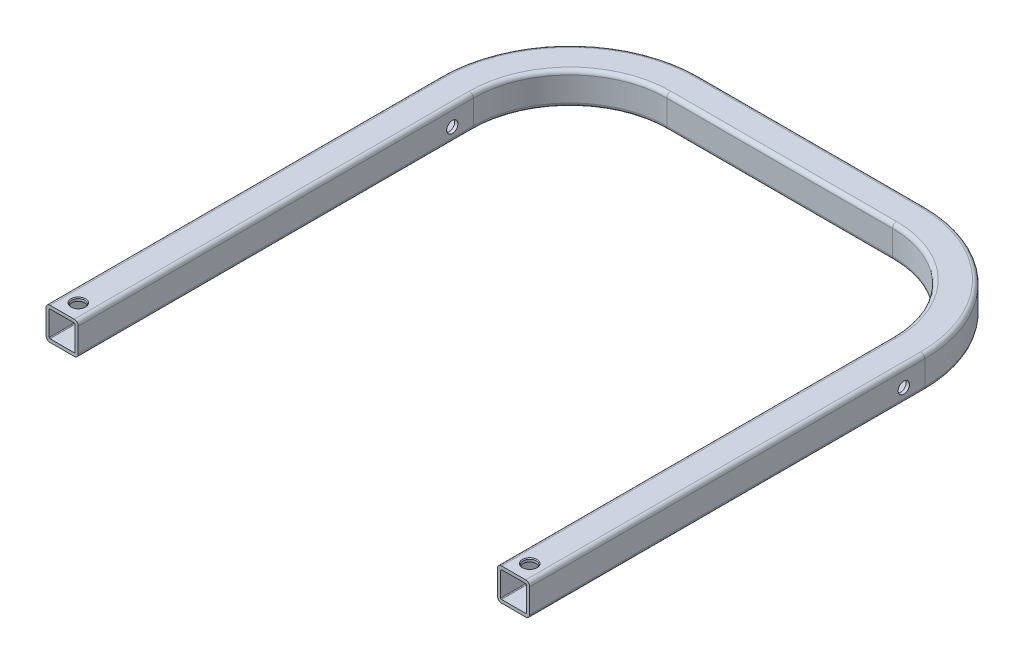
from build123d import *

# Parameters (mm, degrees)
ENL_V_MAT_EXTRU_1_REACH = 360.504
ESQUISSE3_R             = 4
CHANFREIN1_SIZE         = 0.5
ESQUISSE4_R             = 3.5
ENL_V_MAT_EXTRU_2_DEPTH = 443.747106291


with BuildPart() as part:
    # Balayage1: sweep along a path in Esquisse1
    with BuildLine(Plane(origin=(0, 0, 0), x_dir=(1, 0, 0), z_dir=(0, 1, 0))) as balayage1_path:
        Line((-150, 0), (-150, 245))
        ThreePointArc((-150, 245), (-126.568542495, 301.568542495), (-70, 325))
        Line((-70, 325), (70, 325))
        ThreePointArc((70, 325), (126.568542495, 301.568542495), (150, 245))
        Line((150, 245), (150, 0))
    # Esquisse2 → Balayage1 (sweep)
    with BuildSketch(Plane.XY):
        with BuildLine():
            Line((-147.5, 0), (-132.5, 0))
            ThreePointArc((-132.5, 0), (-130.732233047, -0.732233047), (-130, -2.5))
            Line((-130, -2.5), (-130, -17.5))
            ThreePointArc((-130, -17.5), (-130.732233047, -19.267766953), (-132.5, -20))
            Line((-132.5, -20), (-147.5, -20))
            ThreePointArc((-147.5, -20), (-149.267766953, -19.267766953), (-150, -17.5))
            Line((-150, -17.5), (-150, -2.5))
            ThreePointArc((-150, -2.5), (-149.267766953, -0.732233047), (-147.5, 0))
        make_face()
        with BuildLine():
            Line((-147.5, -2), (-132.5, -2))
            ThreePointArc((-132.5, -2), (-132.146446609, -2.146446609), (-132, -2.5))
            Line((-132, -2.5), (-132, -17.5))
            ThreePointArc((-132, -17.5), (-132.146446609, -17.853553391), (-132.5, -18))
            Line((-132.5, -18), (-147.5, -18))
            ThreePointArc((-147.5, -18), (-147.853553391, -17.853553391), (-148, -17.5))
            Line((-148, -17.5), (-148, -2.5))
            ThreePointArc((-148, -2.5), (-147.853553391, -2.146446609), (-147.5, -2))
        make_face(mode=Mode.SUBTRACT)
    sweep(path=balayage1_path.line)

    # Esquisse3 → Enl_v. mat.-Extru.1 (cut, up to next)
    with BuildSketch(Plane(origin=(0, 0, 0), x_dir=(1, 0, 0), z_dir=(0, 1, 0)), mode=Mode.PRIVATE) as enl_v_mat_extru_1_sk1:
        with Locations(Location((-140, 10, 0), (0, 0, 270))):
            Circle(ESQUISSE3_R)
    enl_v_mat_extru_1_tool1 = extrude(enl_v_mat_extru_1_sk1.sketch, amount=-ENL_V_MAT_EXTRU_1_REACH, mode=Mode.PRIVATE) & part.part
    # Esquisse3 → Enl_v. mat.-Extru.1 (cut, up to next)
    with BuildSketch(Plane(origin=(0, 0, 0), x_dir=(1, 0, 0), z_dir=(0, 1, 0)), mode=Mode.PRIVATE) as enl_v_mat_extru_1_sk2:
        with Locations(Location((140, 10, 0), (0, 0, 270))):
            Circle(ESQUISSE3_R)
    enl_v_mat_extru_1_tool2 = extrude(enl_v_mat_extru_1_sk2.sketch, amount=-ENL_V_MAT_EXTRU_1_REACH, mode=Mode.PRIVATE) & part.part
    add(enl_v_mat_extru_1_tool1.solids().sort_by_distance((-140, 0, -10))[0], mode=Mode.SUBTRACT)
    add(enl_v_mat_extru_1_tool2.solids().sort_by_distance((140, 0, -10))[0], mode=Mode.SUBTRACT)

    # Chanfrein1
    chanfrein1_edges = [part.edges().sort_by_distance(p)[0] for p in [
        (-140, 0, -14),
        (140, 0, -14),
    ]]
    chamfer(chanfrein1_edges, length=CHANFREIN1_SIZE)

    # Esquisse4 → Enl_v. mat.-Extru.2 (cut, through all)
    with BuildSketch(Plane.ZY.offset(150)):
        with Locations(Location((-232, -11.5, 0), (0, 0, 90))):
            Circle(ESQUISSE4_R)
    extrude(amount=-ENL_V_MAT_EXTRU_2_DEPTH, mode=Mode.SUBTRACT)


solid = part.part
